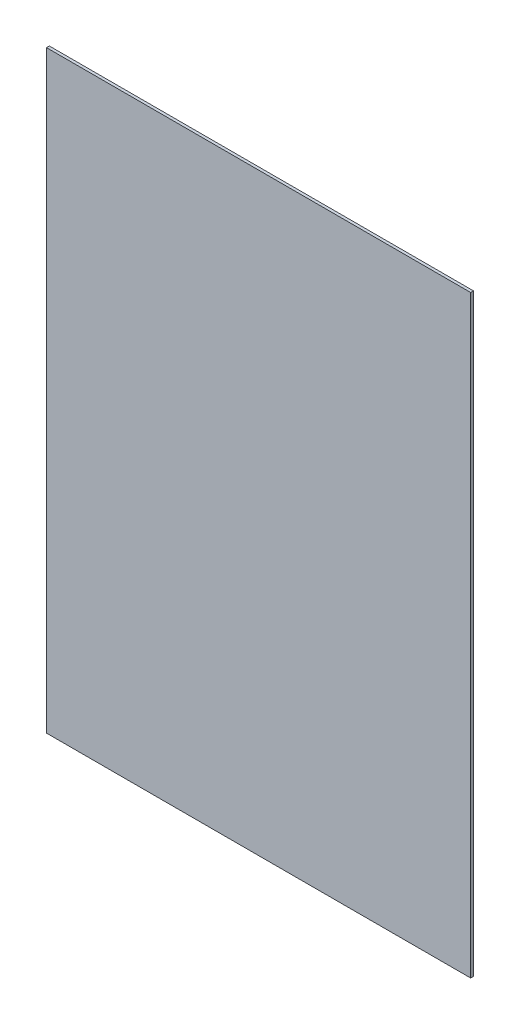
from build123d import *

# Parameters (mm, degrees)
ESQUISSE1_W        = 300
ESQUISSE1_H        = 420
BOSS_EXTRU_1_DEPTH = 2


with BuildPart() as part:
    # Esquisse1 → Boss.-Extru.1 (new body)
    with BuildSketch(Plane.XY):
        with Locations((150, 210)):
            Rectangle(ESQUISSE1_W, ESQUISSE1_H)
    extrude(amount=BOSS_EXTRU_1_DEPTH)


solid = part.part
